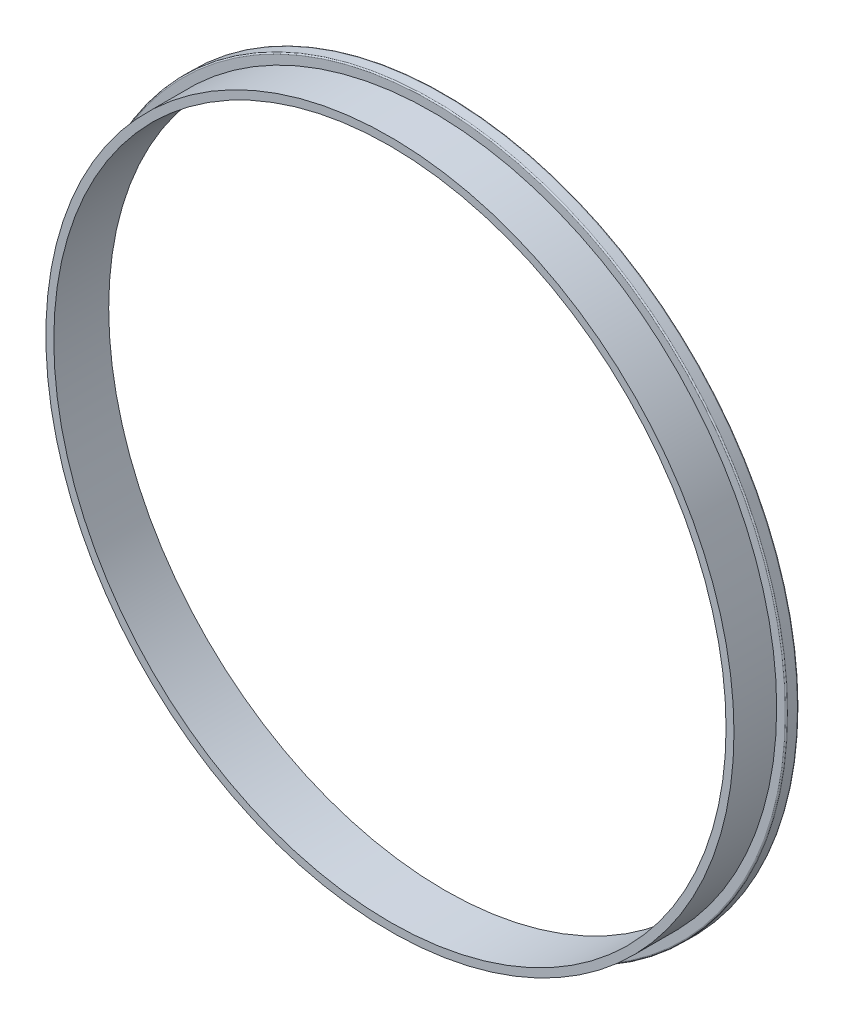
ISO-10303-21;
HEADER;
FILE_DESCRIPTION(('STEP AP214'),'2;1');
FILE_NAME('part.step','',(''),(''),'','','');
FILE_SCHEMA(('AUTOMOTIVE_DESIGN { 1 0 10303 214 1 1 1 1 }'));
ENDSEC;
DATA;
#1=APPLICATION_CONTEXT('core data for automotive mechanical design processes');
#2=APPLICATION_PROTOCOL_DEFINITION('international standard','automotive_design',2000,#1);
#3=PRODUCT_CONTEXT('',#1,'mechanical');
#4=PRODUCT('Part','Part','',(#3));
#5=PRODUCT_RELATED_PRODUCT_CATEGORY('part','',(#4));
#6=PRODUCT_DEFINITION_FORMATION('','',#4);
#7=PRODUCT_DEFINITION_CONTEXT('part definition',#1,'design');
#8=PRODUCT_DEFINITION('design','',#6,#7);
#9=PRODUCT_DEFINITION_SHAPE('','',#8);
#10=(LENGTH_UNIT() NAMED_UNIT(*) SI_UNIT(.MILLI.,.METRE.));
#11=(NAMED_UNIT(*) PLANE_ANGLE_UNIT() SI_UNIT($,.RADIAN.));
#12=(NAMED_UNIT(*) SI_UNIT($,.STERADIAN.) SOLID_ANGLE_UNIT());
#13=UNCERTAINTY_MEASURE_WITH_UNIT(LENGTH_MEASURE(1.E-05),#10,'distance_accuracy_value','');
#14=(GEOMETRIC_REPRESENTATION_CONTEXT(3) GLOBAL_UNCERTAINTY_ASSIGNED_CONTEXT((#13)) GLOBAL_UNIT_ASSIGNED_CONTEXT((#10,
#11,#12)) REPRESENTATION_CONTEXT('',''));
#15=CARTESIAN_POINT('',(0.,0.,0.));
#16=DIRECTION('',(0.,0.,1.));
#17=DIRECTION('',(1.,0.,0.));
#18=AXIS2_PLACEMENT_3D('',#15,#16,#17);
#19=CARTESIAN_POINT('',(0.,0.,9.));
#20=DIRECTION('',(0.,0.,1.));
#21=DIRECTION('',(1.,0.,0.));
#22=AXIS2_PLACEMENT_3D('',#19,#20,#21);
#23=PLANE('',#22);
#24=CARTESIAN_POINT('',(0.,0.,9.));
#25=DIRECTION('',(0.,0.,1.));
#26=DIRECTION('',(1.,0.,0.));
#27=AXIS2_PLACEMENT_3D('',#24,#25,#26);
#28=CIRCLE('',#27,55.1);
#29=CARTESIAN_POINT('',(55.1,0.,9.));
#30=VERTEX_POINT('',#29);
#31=EDGE_CURVE('E54',#30,#30,#28,.T.);
#32=ORIENTED_EDGE('',*,*,#31,.F.);
#33=EDGE_LOOP('',(#32));
#34=FACE_BOUND('',#33,.T.);
#35=CARTESIAN_POINT('',(0.,0.,9.));
#36=DIRECTION('',(0.,0.,1.));
#37=DIRECTION('',(1.,0.,0.));
#38=AXIS2_PLACEMENT_3D('',#35,#36,#37);
#39=CIRCLE('',#38,56.4);
#40=CARTESIAN_POINT('',(56.4,0.,9.));
#41=VERTEX_POINT('',#40);
#42=EDGE_CURVE('E61',#41,#41,#39,.T.);
#43=ORIENTED_EDGE('',*,*,#42,.T.);
#44=EDGE_LOOP('',(#43));
#45=FACE_BOUND('',#44,.T.);
#46=ADVANCED_FACE('F34',(#34,#45),#23,.T.);
#47=CARTESIAN_POINT('',(0.,0.,9.));
#48=DIRECTION('',(0.,0.,-1.));
#49=DIRECTION('',(-1.,0.,0.));
#50=AXIS2_PLACEMENT_3D('',#47,#48,#49);
#51=CYLINDRICAL_SURFACE('',#50,58.);
#52=CARTESIAN_POINT('',(0.,0.,1.8));
#53=DIRECTION('',(0.,0.,1.));
#54=DIRECTION('',(1.,0.,0.));
#55=AXIS2_PLACEMENT_3D('',#52,#53,#54);
#56=CIRCLE('',#55,58.);
#57=CARTESIAN_POINT('',(58.,0.,1.8));
#58=VERTEX_POINT('',#57);
#59=EDGE_CURVE('E41',#58,#58,#56,.F.);
#60=ORIENTED_EDGE('',*,*,#59,.T.);
#61=EDGE_LOOP('',(#60));
#62=FACE_BOUND('',#61,.T.);
#63=CARTESIAN_POINT('',(0.,0.,0.200000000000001));
#64=DIRECTION('',(0.,0.,1.));
#65=DIRECTION('',(1.,0.,0.));
#66=AXIS2_PLACEMENT_3D('',#63,#64,#65);
#67=CIRCLE('',#66,58.);
#68=CARTESIAN_POINT('',(58.,0.,0.200000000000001));
#69=VERTEX_POINT('',#68);
#70=EDGE_CURVE('E45',#69,#69,#67,.T.);
#71=ORIENTED_EDGE('',*,*,#70,.T.);
#72=EDGE_LOOP('',(#71));
#73=FACE_BOUND('',#72,.T.);
#74=ADVANCED_FACE('F87',(#62,#73),#51,.T.);
#75=CARTESIAN_POINT('',(0.,0.,0.));
#76=DIRECTION('',(0.,0.,1.));
#77=DIRECTION('',(1.,0.,0.));
#78=AXIS2_PLACEMENT_3D('',#75,#76,#77);
#79=PLANE('',#78);
#80=CARTESIAN_POINT('',(0.,0.,0.));
#81=DIRECTION('',(0.,0.,1.));
#82=DIRECTION('',(1.,0.,0.));
#83=AXIS2_PLACEMENT_3D('',#80,#81,#82);
#84=CIRCLE('',#83,57.8);
#85=CARTESIAN_POINT('',(57.8,0.,0.));
#86=VERTEX_POINT('',#85);
#87=EDGE_CURVE('E11',#86,#86,#84,.F.);
#88=ORIENTED_EDGE('',*,*,#87,.T.);
#89=EDGE_LOOP('',(#88));
#90=FACE_BOUND('',#89,.T.);
#91=CARTESIAN_POINT('',(0.,0.,0.));
#92=DIRECTION('',(0.,0.,1.));
#93=DIRECTION('',(1.,0.,0.));
#94=AXIS2_PLACEMENT_3D('',#91,#92,#93);
#95=CIRCLE('',#94,55.1);
#96=CARTESIAN_POINT('',(55.1,0.,0.));
#97=VERTEX_POINT('',#96);
#98=EDGE_CURVE('E55',#97,#97,#95,.T.);
#99=ORIENTED_EDGE('',*,*,#98,.T.);
#100=EDGE_LOOP('',(#99));
#101=FACE_BOUND('',#100,.T.);
#102=ADVANCED_FACE('F83',(#90,#101),#79,.F.);
#103=CARTESIAN_POINT('',(0.,0.,9.));
#104=DIRECTION('',(0.,0.,-1.));
#105=DIRECTION('',(-1.,0.,0.));
#106=AXIS2_PLACEMENT_3D('',#103,#104,#105);
#107=CYLINDRICAL_SURFACE('',#106,55.1);
#108=ORIENTED_EDGE('',*,*,#31,.T.);
#109=EDGE_LOOP('',(#108));
#110=FACE_BOUND('',#109,.T.);
#111=ORIENTED_EDGE('',*,*,#98,.F.);
#112=EDGE_LOOP('',(#111));
#113=FACE_BOUND('',#112,.T.);
#114=ADVANCED_FACE('F72',(#110,#113),#107,.F.);
#115=CARTESIAN_POINT('',(0.,0.,2.));
#116=DIRECTION('',(0.,0.,1.));
#117=DIRECTION('',(1.,0.,0.));
#118=AXIS2_PLACEMENT_3D('',#115,#116,#117);
#119=PLANE('',#118);
#120=CARTESIAN_POINT('',(0.,0.,2.));
#121=DIRECTION('',(0.,0.,1.));
#122=DIRECTION('',(1.,0.,0.));
#123=AXIS2_PLACEMENT_3D('',#120,#121,#122);
#124=CIRCLE('',#123,57.8);
#125=CARTESIAN_POINT('',(57.8,0.,2.));
#126=VERTEX_POINT('',#125);
#127=EDGE_CURVE('E49',#126,#126,#124,.T.);
#128=ORIENTED_EDGE('',*,*,#127,.T.);
#129=EDGE_LOOP('',(#128));
#130=FACE_BOUND('',#129,.T.);
#131=CARTESIAN_POINT('',(0.,0.,2.));
#132=DIRECTION('',(0.,0.,1.));
#133=DIRECTION('',(1.,0.,0.));
#134=AXIS2_PLACEMENT_3D('',#131,#132,#133);
#135=CIRCLE('',#134,56.4);
#136=CARTESIAN_POINT('',(56.4,0.,2.));
#137=VERTEX_POINT('',#136);
#138=EDGE_CURVE('E58',#137,#137,#135,.T.);
#139=ORIENTED_EDGE('',*,*,#138,.F.);
#140=EDGE_LOOP('',(#139));
#141=FACE_BOUND('',#140,.T.);
#142=ADVANCED_FACE('F70',(#130,#141),#119,.T.);
#143=CARTESIAN_POINT('',(0.,0.,2.));
#144=DIRECTION('',(0.,0.,1.));
#145=DIRECTION('',(1.,0.,0.));
#146=AXIS2_PLACEMENT_3D('',#143,#144,#145);
#147=CYLINDRICAL_SURFACE('',#146,56.4);
#148=ORIENTED_EDGE('',*,*,#138,.T.);
#149=EDGE_LOOP('',(#148));
#150=FACE_BOUND('',#149,.T.);
#151=ORIENTED_EDGE('',*,*,#42,.F.);
#152=EDGE_LOOP('',(#151));
#153=FACE_BOUND('',#152,.T.);
#154=ADVANCED_FACE('F67',(#150,#153),#147,.T.);
#155=CARTESIAN_POINT('',(0.,0.,1.8));
#156=DIRECTION('',(0.,0.,1.));
#157=DIRECTION('',(1.,0.,0.));
#158=AXIS2_PLACEMENT_3D('',#155,#156,#157);
#159=TOROIDAL_SURFACE('',#158,57.8,0.2);
#160=ORIENTED_EDGE('',*,*,#59,.F.);
#161=EDGE_LOOP('',(#160));
#162=FACE_BOUND('',#161,.T.);
#163=ORIENTED_EDGE('',*,*,#127,.F.);
#164=EDGE_LOOP('',(#163));
#165=FACE_BOUND('',#164,.T.);
#166=ADVANCED_FACE('F80',(#162,#165),#159,.T.);
#167=CARTESIAN_POINT('',(0.,0.,0.200000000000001));
#168=DIRECTION('',(0.,0.,1.));
#169=DIRECTION('',(1.,0.,0.));
#170=AXIS2_PLACEMENT_3D('',#167,#168,#169);
#171=TOROIDAL_SURFACE('',#170,57.8,0.2);
#172=ORIENTED_EDGE('',*,*,#87,.F.);
#173=EDGE_LOOP('',(#172));
#174=FACE_BOUND('',#173,.T.);
#175=ORIENTED_EDGE('',*,*,#70,.F.);
#176=EDGE_LOOP('',(#175));
#177=FACE_BOUND('',#176,.T.);
#178=ADVANCED_FACE('F36',(#174,#177),#171,.T.);
#179=CLOSED_SHELL('',(#46,#74,#102,#114,#142,#154,#166,#178));
#180=MANIFOLD_SOLID_BREP('B2',#179);
#181=ADVANCED_BREP_SHAPE_REPRESENTATION('',(#18,#180),#14);
#182=SHAPE_DEFINITION_REPRESENTATION(#9,#181);
ENDSEC;
END-ISO-10303-21;
